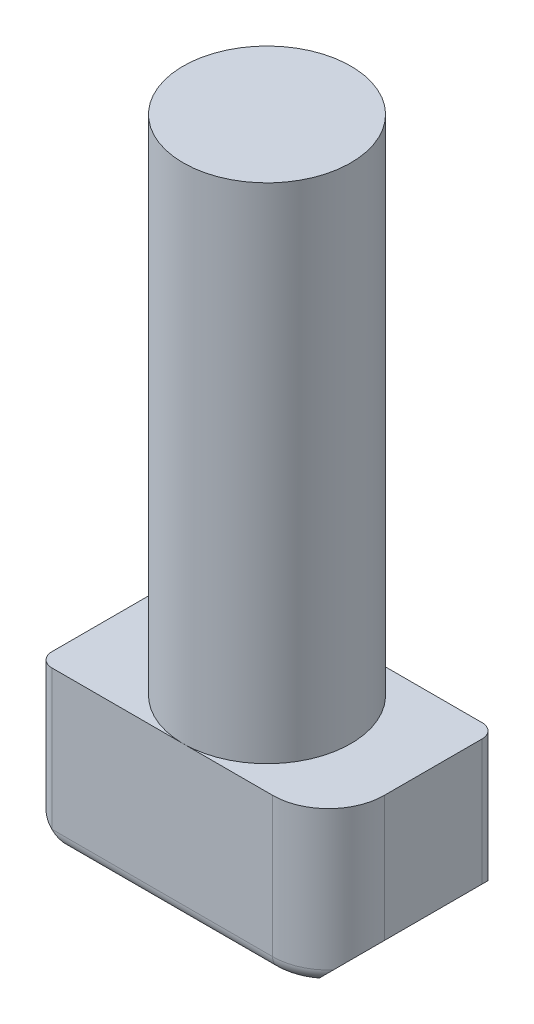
ISO-10303-21;
HEADER;
FILE_DESCRIPTION(('STEP AP214'),'2;1');
FILE_NAME('part.step','',(''),(''),'','','');
FILE_SCHEMA(('AUTOMOTIVE_DESIGN { 1 0 10303 214 1 1 1 1 }'));
ENDSEC;
DATA;
#1=APPLICATION_CONTEXT('core data for automotive mechanical design processes');
#2=APPLICATION_PROTOCOL_DEFINITION('international standard','automotive_design',2000,#1);
#3=PRODUCT_CONTEXT('',#1,'mechanical');
#4=PRODUCT('Part','Part','',(#3));
#5=PRODUCT_RELATED_PRODUCT_CATEGORY('part','',(#4));
#6=PRODUCT_DEFINITION_FORMATION('','',#4);
#7=PRODUCT_DEFINITION_CONTEXT('part definition',#1,'design');
#8=PRODUCT_DEFINITION('design','',#6,#7);
#9=PRODUCT_DEFINITION_SHAPE('','',#8);
#10=(LENGTH_UNIT() NAMED_UNIT(*) SI_UNIT(.MILLI.,.METRE.));
#11=(NAMED_UNIT(*) PLANE_ANGLE_UNIT() SI_UNIT($,.RADIAN.));
#12=(NAMED_UNIT(*) SI_UNIT($,.STERADIAN.) SOLID_ANGLE_UNIT());
#13=UNCERTAINTY_MEASURE_WITH_UNIT(LENGTH_MEASURE(1.E-05),#10,'distance_accuracy_value','');
#14=(GEOMETRIC_REPRESENTATION_CONTEXT(3) GLOBAL_UNCERTAINTY_ASSIGNED_CONTEXT((#13)) GLOBAL_UNIT_ASSIGNED_CONTEXT((#10,
#11,#12)) REPRESENTATION_CONTEXT('',''));
#15=CARTESIAN_POINT('',(0.,0.,0.));
#16=DIRECTION('',(0.,0.,1.));
#17=DIRECTION('',(1.,0.,0.));
#18=AXIS2_PLACEMENT_3D('',#15,#16,#17);
#19=CARTESIAN_POINT('',(5.2,5.50000000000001,3.));
#20=DIRECTION('',(0.,-1.,0.));
#21=DIRECTION('',(0.,0.,-1.));
#22=AXIS2_PLACEMENT_3D('',#19,#20,#21);
#23=PLANE('',#22);
#24=CARTESIAN_POINT('',(0.,5.50000000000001,0.));
#25=DIRECTION('',(0.,1.,0.));
#26=DIRECTION('',(0.,0.,1.));
#27=AXIS2_PLACEMENT_3D('',#24,#25,#26);
#28=CIRCLE('',#27,3.);
#29=CARTESIAN_POINT('',(0.,5.50000000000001,3.));
#30=VERTEX_POINT('',#29);
#31=CARTESIAN_POINT('',(0.,5.50000000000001,-3.));
#32=VERTEX_POINT('',#31);
#33=EDGE_CURVE('E46',#30,#32,#28,.T.);
#34=ORIENTED_EDGE('',*,*,#33,.F.);
#35=DIRECTION('',(-1.,0.,0.));
#36=VECTOR('',#35,1.);
#37=CARTESIAN_POINT('',(5.2,5.50000000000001,3.));
#38=LINE('',#37,#36);
#39=CARTESIAN_POINT('',(3.2,5.50000000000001,3.));
#40=VERTEX_POINT('',#39);
#41=EDGE_CURVE('E144',#40,#30,#38,.T.);
#42=ORIENTED_EDGE('',*,*,#41,.F.);
#43=CARTESIAN_POINT('',(3.2,5.50000000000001,0.999999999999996));
#44=DIRECTION('',(0.,-1.,0.));
#45=DIRECTION('',(0.,0.,-1.));
#46=AXIS2_PLACEMENT_3D('',#43,#44,#45);
#47=CIRCLE('',#46,2.);
#48=CARTESIAN_POINT('',(5.2,5.50000000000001,0.999999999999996));
#49=VERTEX_POINT('',#48);
#50=EDGE_CURVE('E300',#40,#49,#47,.F.);
#51=ORIENTED_EDGE('',*,*,#50,.T.);
#52=DIRECTION('',(0.,0.,1.));
#53=VECTOR('',#52,1.);
#54=CARTESIAN_POINT('',(5.2,5.50000000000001,3.));
#55=LINE('',#54,#53);
#56=CARTESIAN_POINT('',(5.2,5.50000000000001,-2.5));
#57=VERTEX_POINT('',#56);
#58=EDGE_CURVE('E163',#57,#49,#55,.T.);
#59=ORIENTED_EDGE('',*,*,#58,.F.);
#60=CARTESIAN_POINT('',(4.7,5.50000000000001,-2.5));
#61=DIRECTION('',(0.,-1.,0.));
#62=DIRECTION('',(0.,0.,-1.));
#63=AXIS2_PLACEMENT_3D('',#60,#61,#62);
#64=CIRCLE('',#63,0.5);
#65=CARTESIAN_POINT('',(4.7,5.50000000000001,-3.));
#66=VERTEX_POINT('',#65);
#67=EDGE_CURVE('E59',#57,#66,#64,.F.);
#68=ORIENTED_EDGE('',*,*,#67,.T.);
#69=DIRECTION('',(-1.,0.,0.));
#70=VECTOR('',#69,1.);
#71=CARTESIAN_POINT('',(5.2,5.50000000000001,-3.));
#72=LINE('',#71,#70);
#73=EDGE_CURVE('E167',#66,#32,#72,.T.);
#74=ORIENTED_EDGE('',*,*,#73,.T.);
#75=EDGE_LOOP('',(#34,#42,#51,#59,#68,#74));
#76=FACE_BOUND('',#75,.T.);
#77=ADVANCED_FACE('F35',(#76),#23,.F.);
#78=EDGE_CURVE('E11',#32,#30,#28,.T.);
#79=ORIENTED_EDGE('',*,*,#78,.F.);
#80=CARTESIAN_POINT('',(-3.2,5.50000000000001,-3.));
#81=VERTEX_POINT('',#80);
#82=EDGE_CURVE('E156',#32,#81,#72,.T.);
#83=ORIENTED_EDGE('',*,*,#82,.T.);
#84=CARTESIAN_POINT('',(-3.2,5.50000000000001,-1.));
#85=DIRECTION('',(0.,-1.,0.));
#86=DIRECTION('',(0.,0.,-1.));
#87=AXIS2_PLACEMENT_3D('',#84,#85,#86);
#88=CIRCLE('',#87,2.);
#89=CARTESIAN_POINT('',(-5.2,5.50000000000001,-1.));
#90=VERTEX_POINT('',#89);
#91=EDGE_CURVE('E302',#81,#90,#88,.F.);
#92=ORIENTED_EDGE('',*,*,#91,.T.);
#93=DIRECTION('',(0.,0.,1.));
#94=VECTOR('',#93,1.);
#95=CARTESIAN_POINT('',(-5.2,5.50000000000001,3.));
#96=LINE('',#95,#94);
#97=CARTESIAN_POINT('',(-5.2,5.50000000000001,2.5));
#98=VERTEX_POINT('',#97);
#99=EDGE_CURVE('E288',#90,#98,#96,.T.);
#100=ORIENTED_EDGE('',*,*,#99,.T.);
#101=CARTESIAN_POINT('',(-4.7,5.50000000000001,2.5));
#102=DIRECTION('',(0.,-1.,0.));
#103=DIRECTION('',(0.,0.,-1.));
#104=AXIS2_PLACEMENT_3D('',#101,#102,#103);
#105=CIRCLE('',#104,0.5);
#106=CARTESIAN_POINT('',(-4.7,5.50000000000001,3.));
#107=VERTEX_POINT('',#106);
#108=EDGE_CURVE('E161',#98,#107,#105,.F.);
#109=ORIENTED_EDGE('',*,*,#108,.T.);
#110=EDGE_CURVE('E147',#30,#107,#38,.T.);
#111=ORIENTED_EDGE('',*,*,#110,.F.);
#112=EDGE_LOOP('',(#79,#83,#92,#100,#109,#111));
#113=FACE_BOUND('',#112,.T.);
#114=ADVANCED_FACE('F158',(#113),#23,.F.);
#115=CARTESIAN_POINT('',(5.2,5.50000000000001,3.));
#116=DIRECTION('',(0.,0.,-1.));
#117=DIRECTION('',(-1.,0.,0.));
#118=AXIS2_PLACEMENT_3D('',#115,#116,#117);
#119=PLANE('',#118);
#120=DIRECTION('',(0.,-1.,0.));
#121=VECTOR('',#120,1.);
#122=CARTESIAN_POINT('',(-4.7,5.50000000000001,3.));
#123=LINE('',#122,#121);
#124=CARTESIAN_POINT('',(-4.7,0.500000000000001,3.));
#125=VERTEX_POINT('',#124);
#126=EDGE_CURVE('E219',#107,#125,#123,.T.);
#127=ORIENTED_EDGE('',*,*,#126,.T.);
#128=DIRECTION('',(-1.,0.,0.));
#129=VECTOR('',#128,1.);
#130=CARTESIAN_POINT('',(5.2,0.5,3.));
#131=LINE('',#130,#129);
#132=CARTESIAN_POINT('',(3.2,0.5,3.));
#133=VERTEX_POINT('',#132);
#134=EDGE_CURVE('E338',#125,#133,#131,.F.);
#135=ORIENTED_EDGE('',*,*,#134,.T.);
#136=DIRECTION('',(0.,-1.,0.));
#137=VECTOR('',#136,1.);
#138=CARTESIAN_POINT('',(3.2,5.50000000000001,3.));
#139=LINE('',#138,#137);
#140=EDGE_CURVE('E151',#133,#40,#139,.F.);
#141=ORIENTED_EDGE('',*,*,#140,.T.);
#142=ORIENTED_EDGE('',*,*,#41,.T.);
#143=ORIENTED_EDGE('',*,*,#110,.T.);
#144=EDGE_LOOP('',(#127,#135,#141,#142,#143));
#145=FACE_BOUND('',#144,.T.);
#146=ADVANCED_FACE('F146',(#145),#119,.F.);
#147=CARTESIAN_POINT('',(5.2,0.,3.));
#148=DIRECTION('',(0.,1.,0.));
#149=DIRECTION('',(0.,0.,1.));
#150=AXIS2_PLACEMENT_3D('',#147,#148,#149);
#151=PLANE('',#150);
#152=CARTESIAN_POINT('',(3.2,0.,0.999999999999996));
#153=DIRECTION('',(0.,1.,0.));
#154=DIRECTION('',(0.,0.,1.));
#155=AXIS2_PLACEMENT_3D('',#152,#153,#154);
#156=CIRCLE('',#155,1.5);
#157=CARTESIAN_POINT('',(3.99289321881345,0.,2.27331078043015));
#158=VERTEX_POINT('',#157);
#159=CARTESIAN_POINT('',(3.2,0.,2.5));
#160=VERTEX_POINT('',#159);
#161=EDGE_CURVE('E324',#158,#160,#156,.F.);
#162=ORIENTED_EDGE('',*,*,#161,.T.);
#163=DIRECTION('',(-1.,0.,0.));
#164=VECTOR('',#163,1.);
#165=CARTESIAN_POINT('',(5.2,0.,2.5));
#166=LINE('',#165,#164);
#167=CARTESIAN_POINT('',(-3.99289321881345,0.,2.5));
#168=VERTEX_POINT('',#167);
#169=EDGE_CURVE('E326',#160,#168,#166,.T.);
#170=ORIENTED_EDGE('',*,*,#169,.T.);
#171=DIRECTION('',(0.,0.,1.));
#172=VECTOR('',#171,1.);
#173=CARTESIAN_POINT('',(-3.99289321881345,0.,-2.73205080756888));
#174=LINE('',#173,#172);
#175=CARTESIAN_POINT('',(-3.99289321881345,0.,-2.27331078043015));
#176=VERTEX_POINT('',#175);
#177=EDGE_CURVE('E316',#168,#176,#174,.F.);
#178=ORIENTED_EDGE('',*,*,#177,.T.);
#179=CARTESIAN_POINT('',(-3.2,0.,-1.));
#180=DIRECTION('',(0.,1.,0.));
#181=DIRECTION('',(0.,0.,1.));
#182=AXIS2_PLACEMENT_3D('',#179,#180,#181);
#183=CIRCLE('',#182,1.5);
#184=CARTESIAN_POINT('',(-3.2,0.,-2.5));
#185=VERTEX_POINT('',#184);
#186=EDGE_CURVE('E318',#176,#185,#183,.F.);
#187=ORIENTED_EDGE('',*,*,#186,.T.);
#188=DIRECTION('',(-1.,0.,0.));
#189=VECTOR('',#188,1.);
#190=CARTESIAN_POINT('',(5.2,0.,-2.5));
#191=LINE('',#190,#189);
#192=CARTESIAN_POINT('',(3.99289321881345,0.,-2.5));
#193=VERTEX_POINT('',#192);
#194=EDGE_CURVE('E320',#185,#193,#191,.F.);
#195=ORIENTED_EDGE('',*,*,#194,.T.);
#196=DIRECTION('',(0.,0.,1.));
#197=VECTOR('',#196,1.);
#198=CARTESIAN_POINT('',(3.99289321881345,0.,2.73205080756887));
#199=LINE('',#198,#197);
#200=EDGE_CURVE('E322',#193,#158,#199,.T.);
#201=ORIENTED_EDGE('',*,*,#200,.T.);
#202=EDGE_LOOP('',(#162,#170,#178,#187,#195,#201));
#203=FACE_BOUND('',#202,.T.);
#204=ADVANCED_FACE('F196',(#203),#151,.F.);
#205=CARTESIAN_POINT('',(5.2,5.50000000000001,-3.));
#206=DIRECTION('',(0.,0.,1.));
#207=DIRECTION('',(1.,0.,0.));
#208=AXIS2_PLACEMENT_3D('',#205,#206,#207);
#209=PLANE('',#208);
#210=DIRECTION('',(0.,1.,0.));
#211=VECTOR('',#210,1.);
#212=CARTESIAN_POINT('',(4.7,1.,-3.));
#213=LINE('',#212,#211);
#214=CARTESIAN_POINT('',(4.7,0.5,-3.));
#215=VERTEX_POINT('',#214);
#216=EDGE_CURVE('E266',#66,#215,#213,.F.);
#217=ORIENTED_EDGE('',*,*,#216,.T.);
#218=DIRECTION('',(-1.,0.,0.));
#219=VECTOR('',#218,1.);
#220=CARTESIAN_POINT('',(5.2,0.5,-3.));
#221=LINE('',#220,#219);
#222=CARTESIAN_POINT('',(-3.2,0.5,-3.));
#223=VERTEX_POINT('',#222);
#224=EDGE_CURVE('E270',#215,#223,#221,.T.);
#225=ORIENTED_EDGE('',*,*,#224,.T.);
#226=DIRECTION('',(0.,1.,0.));
#227=VECTOR('',#226,1.);
#228=CARTESIAN_POINT('',(-3.2,5.50000000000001,-3.));
#229=LINE('',#228,#227);
#230=EDGE_CURVE('E297',#223,#81,#229,.T.);
#231=ORIENTED_EDGE('',*,*,#230,.T.);
#232=ORIENTED_EDGE('',*,*,#82,.F.);
#233=ORIENTED_EDGE('',*,*,#73,.F.);
#234=EDGE_LOOP('',(#217,#225,#231,#232,#233));
#235=FACE_BOUND('',#234,.T.);
#236=ADVANCED_FACE('F192',(#235),#209,.F.);
#237=CARTESIAN_POINT('',(5.2,0.,0.));
#238=DIRECTION('',(1.,0.,0.));
#239=DIRECTION('',(0.,0.,-1.));
#240=AXIS2_PLACEMENT_3D('',#237,#238,#239);
#241=PLANE('',#240);
#242=DIRECTION('',(0.,0.,-1.));
#243=VECTOR('',#242,1.);
#244=CARTESIAN_POINT('',(5.2,0.999999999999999,-3.));
#245=LINE('',#244,#243);
#246=CARTESIAN_POINT('',(5.2,0.999999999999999,0.999999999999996));
#247=VERTEX_POINT('',#246);
#248=CARTESIAN_POINT('',(5.2,0.999999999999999,-2.5));
#249=VERTEX_POINT('',#248);
#250=EDGE_CURVE('E294',#247,#249,#245,.T.);
#251=ORIENTED_EDGE('',*,*,#250,.T.);
#252=DIRECTION('',(0.,1.,0.));
#253=VECTOR('',#252,1.);
#254=CARTESIAN_POINT('',(5.2,5.50000000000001,-2.5));
#255=LINE('',#254,#253);
#256=EDGE_CURVE('E44',#249,#57,#255,.T.);
#257=ORIENTED_EDGE('',*,*,#256,.T.);
#258=ORIENTED_EDGE('',*,*,#58,.T.);
#259=DIRECTION('',(0.,-1.,0.));
#260=VECTOR('',#259,1.);
#261=CARTESIAN_POINT('',(5.2,1.,0.999999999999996));
#262=LINE('',#261,#260);
#263=EDGE_CURVE('E309',#49,#247,#262,.T.);
#264=ORIENTED_EDGE('',*,*,#263,.T.);
#265=EDGE_LOOP('',(#251,#257,#258,#264));
#266=FACE_BOUND('',#265,.T.);
#267=ADVANCED_FACE('F195',(#266),#241,.T.);
#268=CARTESIAN_POINT('',(-5.2,0.,0.));
#269=DIRECTION('',(1.,0.,0.));
#270=DIRECTION('',(0.,0.,-1.));
#271=AXIS2_PLACEMENT_3D('',#268,#269,#270);
#272=PLANE('',#271);
#273=DIRECTION('',(0.,0.,1.));
#274=VECTOR('',#273,1.);
#275=CARTESIAN_POINT('',(-5.2,1.,0.));
#276=LINE('',#275,#274);
#277=CARTESIAN_POINT('',(-5.2,1.,-1.));
#278=VERTEX_POINT('',#277);
#279=CARTESIAN_POINT('',(-5.2,1.,2.5));
#280=VERTEX_POINT('',#279);
#281=EDGE_CURVE('E291',#278,#280,#276,.T.);
#282=ORIENTED_EDGE('',*,*,#281,.T.);
#283=DIRECTION('',(0.,-1.,0.));
#284=VECTOR('',#283,1.);
#285=CARTESIAN_POINT('',(-5.2,0.,2.5));
#286=LINE('',#285,#284);
#287=EDGE_CURVE('E274',#280,#98,#286,.F.);
#288=ORIENTED_EDGE('',*,*,#287,.T.);
#289=ORIENTED_EDGE('',*,*,#99,.F.);
#290=DIRECTION('',(0.,1.,0.));
#291=VECTOR('',#290,1.);
#292=CARTESIAN_POINT('',(-5.2,0.,-1.));
#293=LINE('',#292,#291);
#294=EDGE_CURVE('E304',#90,#278,#293,.F.);
#295=ORIENTED_EDGE('',*,*,#294,.T.);
#296=EDGE_LOOP('',(#282,#288,#289,#295));
#297=FACE_BOUND('',#296,.T.);
#298=ADVANCED_FACE('F191',(#297),#272,.F.);
#299=CARTESIAN_POINT('',(-4.2,0.,3.));
#300=DIRECTION('',(0.707106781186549,0.707106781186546,0.));
#301=DIRECTION('',(0.,0.,-1.));
#302=AXIS2_PLACEMENT_3D('',#299,#300,#301);
#303=PLANE('',#302);
#304=CARTESIAN_POINT('',(-3.2,-1.,-1.));
#305=DIRECTION('',(0.707106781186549,0.707106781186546,0.));
#306=DIRECTION('',(-0.707106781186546,0.707106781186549,0.));
#307=AXIS2_PLACEMENT_3D('',#304,#305,#306);
#308=ELLIPSE('',#307,2.8284271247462,2.);
#309=CARTESIAN_POINT('',(-4.7,0.5,-2.3228756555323));
#310=VERTEX_POINT('',#309);
#311=EDGE_CURVE('E306',#278,#310,#308,.F.);
#312=ORIENTED_EDGE('',*,*,#311,.T.);
#313=CARTESIAN_POINT('',(-4.7,0.5,-2.3228756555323));
#314=CARTESIAN_POINT('',(-4.67691929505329,0.476919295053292,-2.34901354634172));
#315=CARTESIAN_POINT('',(-4.65236190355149,0.452361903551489,-2.3730731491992));
#316=CARTESIAN_POINT('',(-4.60023403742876,0.40023403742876,-2.41537261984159));
#317=CARTESIAN_POINT('',(-4.57261327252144,0.372613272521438,-2.43348696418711));
#318=CARTESIAN_POINT('',(-4.52750182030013,0.327501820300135,-2.45514134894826));
#319=CARTESIAN_POINT('',(-4.51072219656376,0.310722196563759,-2.46160181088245));
#320=CARTESIAN_POINT('',(-4.47682207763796,0.276822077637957,-2.47103537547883));
#321=CARTESIAN_POINT('',(-4.45970611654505,0.259706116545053,-2.47403990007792));
#322=CARTESIAN_POINT('',(-4.42640164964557,0.226401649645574,-2.4759296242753));
#323=CARTESIAN_POINT('',(-4.41022211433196,0.210222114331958,-2.47506078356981));
#324=CARTESIAN_POINT('',(-4.37801381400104,0.178013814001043,-2.46913965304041));
#325=CARTESIAN_POINT('',(-4.3619911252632,0.161991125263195,-2.46402367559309));
#326=CARTESIAN_POINT('',(-4.34644660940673,0.146446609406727,-2.45647531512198));
#327=B_SPLINE_CURVE_WITH_KNOTS('',3,(#313,#314,#315,#316,#317,#318,#319,#320,#321,#322,#323,
#324,#325,#326),.UNSPECIFIED.,.F.,.F.,(4,2,2,2,2,2,4),(0.,0.125892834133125,0.254294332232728,
0.327863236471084,0.400757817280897,0.469091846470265,0.538469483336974),.UNSPECIFIED.);
#328=CARTESIAN_POINT('',(-4.34644660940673,0.146446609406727,-2.45647531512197));
#329=VERTEX_POINT('',#328);
#330=EDGE_CURVE('E212',#310,#329,#327,.T.);
#331=ORIENTED_EDGE('',*,*,#330,.T.);
#332=DIRECTION('',(0.,0.,-1.));
#333=VECTOR('',#332,1.);
#334=CARTESIAN_POINT('',(-4.34644660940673,0.146446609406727,3.));
#335=LINE('',#334,#333);
#336=CARTESIAN_POINT('',(-4.34644660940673,0.146446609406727,2.85355339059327));
#337=VERTEX_POINT('',#336);
#338=EDGE_CURVE('E220',#329,#337,#335,.F.);
#339=ORIENTED_EDGE('',*,*,#338,.T.);
#340=CARTESIAN_POINT('',(-4.7,0.5,2.5));
#341=DIRECTION('',(0.707106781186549,0.707106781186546,0.));
#342=DIRECTION('',(-0.707106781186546,0.707106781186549,0.));
#343=AXIS2_PLACEMENT_3D('',#340,#341,#342);
#344=ELLIPSE('',#343,0.707106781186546,0.5);
#345=EDGE_CURVE('E330',#337,#125,#344,.F.);
#346=ORIENTED_EDGE('',*,*,#345,.T.);
#347=CARTESIAN_POINT('',(-4.7,0.5,2.5));
#348=DIRECTION('',(0.707106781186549,0.707106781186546,0.));
#349=DIRECTION('',(0.707106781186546,-0.707106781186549,0.));
#350=AXIS2_PLACEMENT_3D('',#347,#348,#349);
#351=ELLIPSE('',#350,0.707106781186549,0.5);
#352=EDGE_CURVE('E329',#125,#280,#351,.F.);
#353=ORIENTED_EDGE('',*,*,#352,.T.);
#354=ORIENTED_EDGE('',*,*,#281,.F.);
#355=EDGE_LOOP('',(#312,#331,#339,#346,#353,#354));
#356=FACE_BOUND('',#355,.T.);
#357=ADVANCED_FACE('F203',(#356),#303,.F.);
#358=CARTESIAN_POINT('',(5.2,0.999999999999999,0.));
#359=DIRECTION('',(0.707106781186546,-0.707106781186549,0.));
#360=DIRECTION('',(0.,0.,1.));
#361=AXIS2_PLACEMENT_3D('',#358,#359,#360);
#362=PLANE('',#361);
#363=CARTESIAN_POINT('',(3.2,-0.999999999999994,0.999999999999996));
#364=DIRECTION('',(0.707106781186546,-0.707106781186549,0.));
#365=DIRECTION('',(0.707106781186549,0.707106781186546,0.));
#366=AXIS2_PLACEMENT_3D('',#363,#364,#365);
#367=ELLIPSE('',#366,2.82842712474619,2.);
#368=CARTESIAN_POINT('',(4.7,0.5,2.32287565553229));
#369=VERTEX_POINT('',#368);
#370=EDGE_CURVE('E312',#247,#369,#367,.T.);
#371=ORIENTED_EDGE('',*,*,#370,.T.);
#372=CARTESIAN_POINT('',(4.7,0.5,2.32287565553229));
#373=CARTESIAN_POINT('',(4.67691929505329,0.476919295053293,2.34901354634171));
#374=CARTESIAN_POINT('',(4.65236190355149,0.45236190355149,2.37307314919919));
#375=CARTESIAN_POINT('',(4.60023403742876,0.400234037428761,2.41537261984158));
#376=CARTESIAN_POINT('',(4.57261327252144,0.372613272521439,2.43348696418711));
#377=CARTESIAN_POINT('',(4.52750182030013,0.327501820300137,2.45514134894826));
#378=CARTESIAN_POINT('',(4.51072219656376,0.310722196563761,2.46160181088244));
#379=CARTESIAN_POINT('',(4.47682207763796,0.276822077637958,2.47103537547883));
#380=CARTESIAN_POINT('',(4.45970611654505,0.259706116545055,2.47403990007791));
#381=CARTESIAN_POINT('',(4.42640164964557,0.226401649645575,2.47592962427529));
#382=CARTESIAN_POINT('',(4.41022211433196,0.210222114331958,2.47506078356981));
#383=CARTESIAN_POINT('',(4.37801381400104,0.178013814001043,2.46913965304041));
#384=CARTESIAN_POINT('',(4.36199112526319,0.161991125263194,2.46402367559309));
#385=CARTESIAN_POINT('',(4.34644660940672,0.146446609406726,2.45647531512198));
#386=B_SPLINE_CURVE_WITH_KNOTS('',3,(#372,#373,#374,#375,#376,#377,#378,#379,#380,#381,#382,
#383,#384,#385),.UNSPECIFIED.,.F.,.F.,(4,2,2,2,2,2,4),(0.,0.125892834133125,0.254294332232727,
0.327863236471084,0.400757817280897,0.469091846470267,0.538469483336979),.UNSPECIFIED.);
#387=CARTESIAN_POINT('',(4.34644660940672,0.146446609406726,2.45647531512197));
#388=VERTEX_POINT('',#387);
#389=EDGE_CURVE('E260',#369,#388,#386,.T.);
#390=ORIENTED_EDGE('',*,*,#389,.T.);
#391=DIRECTION('',(0.,0.,1.));
#392=VECTOR('',#391,1.);
#393=CARTESIAN_POINT('',(4.34644660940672,0.146446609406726,-3.));
#394=LINE('',#393,#392);
#395=CARTESIAN_POINT('',(4.34644660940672,0.146446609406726,-2.85355339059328));
#396=VERTEX_POINT('',#395);
#397=EDGE_CURVE('E267',#388,#396,#394,.F.);
#398=ORIENTED_EDGE('',*,*,#397,.T.);
#399=CARTESIAN_POINT('',(4.7,0.5,-2.5));
#400=DIRECTION('',(0.707106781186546,-0.707106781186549,0.));
#401=DIRECTION('',(-0.707106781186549,-0.707106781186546,0.));
#402=AXIS2_PLACEMENT_3D('',#399,#400,#401);
#403=ELLIPSE('',#402,0.707106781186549,0.5);
#404=EDGE_CURVE('E345',#396,#215,#403,.T.);
#405=ORIENTED_EDGE('',*,*,#404,.T.);
#406=CARTESIAN_POINT('',(4.7,0.5,-2.5));
#407=DIRECTION('',(0.707106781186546,-0.707106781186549,0.));
#408=DIRECTION('',(-0.707106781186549,-0.707106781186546,0.));
#409=AXIS2_PLACEMENT_3D('',#406,#407,#408);
#410=ELLIPSE('',#409,0.707106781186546,0.5);
#411=EDGE_CURVE('E342',#215,#249,#410,.T.);
#412=ORIENTED_EDGE('',*,*,#411,.T.);
#413=ORIENTED_EDGE('',*,*,#250,.F.);
#414=EDGE_LOOP('',(#371,#390,#398,#405,#412,#413));
#415=FACE_BOUND('',#414,.T.);
#416=ADVANCED_FACE('F207',(#415),#362,.T.);
#417=CARTESIAN_POINT('',(-3.2,5.50000000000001,-1.));
#418=DIRECTION('',(0.,1.,0.));
#419=DIRECTION('',(0.,0.,1.));
#420=AXIS2_PLACEMENT_3D('',#417,#418,#419);
#421=CYLINDRICAL_SURFACE('',#420,2.);
#422=ORIENTED_EDGE('',*,*,#230,.F.);
#423=CARTESIAN_POINT('',(-3.2,0.5,-1.));
#424=DIRECTION('',(0.,1.,0.));
#425=DIRECTION('',(0.,0.,1.));
#426=AXIS2_PLACEMENT_3D('',#423,#424,#425);
#427=CIRCLE('',#426,2.);
#428=EDGE_CURVE('E272',#223,#310,#427,.T.);
#429=ORIENTED_EDGE('',*,*,#428,.T.);
#430=ORIENTED_EDGE('',*,*,#311,.F.);
#431=ORIENTED_EDGE('',*,*,#294,.F.);
#432=ORIENTED_EDGE('',*,*,#91,.F.);
#433=EDGE_LOOP('',(#422,#429,#430,#431,#432));
#434=FACE_BOUND('',#433,.T.);
#435=ADVANCED_FACE('F380',(#434),#421,.T.);
#436=CARTESIAN_POINT('',(3.2,0.,0.999999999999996));
#437=DIRECTION('',(0.,1.,0.));
#438=DIRECTION('',(0.,0.,1.));
#439=AXIS2_PLACEMENT_3D('',#436,#437,#438);
#440=CYLINDRICAL_SURFACE('',#439,2.);
#441=ORIENTED_EDGE('',*,*,#140,.F.);
#442=CARTESIAN_POINT('',(3.2,0.5,0.999999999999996));
#443=DIRECTION('',(0.,1.,0.));
#444=DIRECTION('',(0.,0.,1.));
#445=AXIS2_PLACEMENT_3D('',#442,#443,#444);
#446=CIRCLE('',#445,2.);
#447=EDGE_CURVE('E341',#133,#369,#446,.T.);
#448=ORIENTED_EDGE('',*,*,#447,.T.);
#449=ORIENTED_EDGE('',*,*,#370,.F.);
#450=ORIENTED_EDGE('',*,*,#263,.F.);
#451=ORIENTED_EDGE('',*,*,#50,.F.);
#452=EDGE_LOOP('',(#441,#448,#449,#450,#451));
#453=FACE_BOUND('',#452,.T.);
#454=ADVANCED_FACE('F366',(#453),#440,.T.);
#455=CARTESIAN_POINT('',(5.2,0.5,-2.5));
#456=DIRECTION('',(-1.,0.,0.));
#457=DIRECTION('',(0.,0.,1.));
#458=AXIS2_PLACEMENT_3D('',#455,#456,#457);
#459=CYLINDRICAL_SURFACE('',#458,0.5);
#460=ORIENTED_EDGE('',*,*,#224,.F.);
#461=ORIENTED_EDGE('',*,*,#404,.F.);
#462=CARTESIAN_POINT('',(3.99289321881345,0.5,-2.5));
#463=DIRECTION('',(-0.707106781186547,0.,-0.707106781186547));
#464=DIRECTION('',(-0.707106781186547,0.,0.707106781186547));
#465=AXIS2_PLACEMENT_3D('',#462,#463,#464);
#466=ELLIPSE('',#465,0.707106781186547,0.5);
#467=EDGE_CURVE('E39',#193,#396,#466,.F.);
#468=ORIENTED_EDGE('',*,*,#467,.F.);
#469=ORIENTED_EDGE('',*,*,#194,.F.);
#470=CARTESIAN_POINT('',(-3.2,0.5,-2.5));
#471=DIRECTION('',(-1.,0.,0.));
#472=DIRECTION('',(0.,0.,1.));
#473=AXIS2_PLACEMENT_3D('',#470,#471,#472);
#474=CIRCLE('',#473,0.5);
#475=EDGE_CURVE('E252',#223,#185,#474,.T.);
#476=ORIENTED_EDGE('',*,*,#475,.F.);
#477=EDGE_LOOP('',(#460,#461,#468,#469,#476));
#478=FACE_BOUND('',#477,.T.);
#479=ADVANCED_FACE('F257',(#478),#459,.T.);
#480=CARTESIAN_POINT('',(3.99289321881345,0.5,3.));
#481=DIRECTION('',(0.,0.,-1.));
#482=DIRECTION('',(-1.,0.,0.));
#483=AXIS2_PLACEMENT_3D('',#480,#481,#482);
#484=CYLINDRICAL_SURFACE('',#483,0.5);
#485=ORIENTED_EDGE('',*,*,#467,.T.);
#486=ORIENTED_EDGE('',*,*,#397,.F.);
#487=CARTESIAN_POINT('',(4.34644660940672,0.146446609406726,2.45647531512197));
#488=CARTESIAN_POINT('',(4.32511597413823,0.125091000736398,2.44612281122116));
#489=CARTESIAN_POINT('',(4.30210601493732,0.105965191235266,2.43483843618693));
#490=CARTESIAN_POINT('',(4.2536708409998,0.0723834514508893,2.41076479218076));
#491=CARTESIAN_POINT('',(4.22825076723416,0.057917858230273,2.39797871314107));
#492=CARTESIAN_POINT('',(4.17589652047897,0.0338012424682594,2.37124221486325));
#493=CARTESIAN_POINT('',(4.14896559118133,0.0241403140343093,2.35729426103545));
#494=CARTESIAN_POINT('',(4.09433693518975,0.00958567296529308,2.32852905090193));
#495=CARTESIAN_POINT('',(4.06664024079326,0.00468583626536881,2.313712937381));
#496=CARTESIAN_POINT('',(4.02498260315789,0.000834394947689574,2.29103037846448));
#497=CARTESIAN_POINT('',(4.01104626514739,0.000136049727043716,2.28337526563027));
#498=CARTESIAN_POINT('',(3.99572253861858,6.00630067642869E-06,2.2748812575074));
#499=CARTESIAN_POINT('',(3.9943077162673,4.31352516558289E-09,2.27409629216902));
#500=CARTESIAN_POINT('',(3.99289321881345,0.,2.27331078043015));
#501=B_SPLINE_CURVE_WITH_KNOTS('',3,(#487,#488,#489,#490,#491,#492,#493,#494,#495,#496,#497,
#498,#499,#500),.UNSPECIFIED.,.F.,.F.,(4,2,2,2,2,2,4),(0.,0.0955017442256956,0.190804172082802,
0.285909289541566,0.380891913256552,0.428599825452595,0.433453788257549),.UNSPECIFIED.);
#502=EDGE_CURVE('E245',#158,#388,#501,.F.);
#503=ORIENTED_EDGE('',*,*,#502,.F.);
#504=ORIENTED_EDGE('',*,*,#200,.F.);
#505=EDGE_LOOP('',(#485,#486,#503,#504));
#506=FACE_BOUND('',#505,.T.);
#507=ADVANCED_FACE('F229',(#506),#484,.T.);
#508=CARTESIAN_POINT('',(-3.2,0.5,-1.));
#509=DIRECTION('',(0.,1.,0.));
#510=DIRECTION('',(0.,0.,1.));
#511=AXIS2_PLACEMENT_3D('',#508,#509,#510);
#512=TOROIDAL_SURFACE('',#511,1.5,0.5);
#513=ORIENTED_EDGE('',*,*,#475,.T.);
#514=ORIENTED_EDGE('',*,*,#186,.F.);
#515=CARTESIAN_POINT('',(-4.34644660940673,0.146446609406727,-2.45647531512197));
#516=CARTESIAN_POINT('',(-4.32511597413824,0.1250910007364,-2.44612281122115));
#517=CARTESIAN_POINT('',(-4.30210601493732,0.10596519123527,-2.43483843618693));
#518=CARTESIAN_POINT('',(-4.25367084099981,0.0723834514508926,-2.41076479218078));
#519=CARTESIAN_POINT('',(-4.22825076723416,0.0579178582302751,-2.39797871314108));
#520=CARTESIAN_POINT('',(-4.17589652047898,0.0338012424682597,-2.37124221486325));
#521=CARTESIAN_POINT('',(-4.14896559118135,0.0241403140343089,-2.35729426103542));
#522=CARTESIAN_POINT('',(-4.09433693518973,0.00958567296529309,-2.32852905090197));
#523=CARTESIAN_POINT('',(-4.06664024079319,0.00468583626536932,-2.31371293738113));
#524=CARTESIAN_POINT('',(-4.02498260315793,0.000834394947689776,-2.29103037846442));
#525=CARTESIAN_POINT('',(-4.01104626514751,0.000136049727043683,-2.28337526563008));
#526=CARTESIAN_POINT('',(-3.9957225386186,6.00630067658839E-06,-2.27488125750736));
#527=CARTESIAN_POINT('',(-3.99430771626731,4.31352534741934E-09,-2.27409629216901));
#528=CARTESIAN_POINT('',(-3.99289321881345,0.,-2.27331078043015));
#529=B_SPLINE_CURVE_WITH_KNOTS('',3,(#515,#516,#517,#518,#519,#520,#521,#522,#523,#524,#525,
#526,#527,#528),.UNSPECIFIED.,.F.,.F.,(4,2,2,2,2,2,4),(0.,0.0955017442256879,0.190804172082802,
0.285909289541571,0.380891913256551,0.428599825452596,0.433453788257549),.UNSPECIFIED.);
#530=EDGE_CURVE('E238',#329,#176,#529,.T.);
#531=ORIENTED_EDGE('',*,*,#530,.F.);
#532=ORIENTED_EDGE('',*,*,#330,.F.);
#533=ORIENTED_EDGE('',*,*,#428,.F.);
#534=EDGE_LOOP('',(#513,#514,#531,#532,#533));
#535=FACE_BOUND('',#534,.T.);
#536=ADVANCED_FACE('F223',(#535),#512,.T.);
#537=CARTESIAN_POINT('',(3.2,0.5,0.999999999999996));
#538=DIRECTION('',(0.,1.,0.));
#539=DIRECTION('',(0.,0.,1.));
#540=AXIS2_PLACEMENT_3D('',#537,#538,#539);
#541=TOROIDAL_SURFACE('',#540,1.5,0.5);
#542=ORIENTED_EDGE('',*,*,#389,.F.);
#543=ORIENTED_EDGE('',*,*,#447,.F.);
#544=CARTESIAN_POINT('',(3.2,0.5,2.5));
#545=DIRECTION('',(-1.,0.,0.));
#546=DIRECTION('',(0.,0.,1.));
#547=AXIS2_PLACEMENT_3D('',#544,#545,#546);
#548=CIRCLE('',#547,0.5);
#549=EDGE_CURVE('E246',#160,#133,#548,.T.);
#550=ORIENTED_EDGE('',*,*,#549,.F.);
#551=ORIENTED_EDGE('',*,*,#161,.F.);
#552=ORIENTED_EDGE('',*,*,#502,.T.);
#553=EDGE_LOOP('',(#542,#543,#550,#551,#552));
#554=FACE_BOUND('',#553,.T.);
#555=ADVANCED_FACE('F228',(#554),#541,.T.);
#556=CARTESIAN_POINT('',(-3.99289321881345,0.5,3.));
#557=DIRECTION('',(0.,0.,-1.));
#558=DIRECTION('',(-1.,0.,0.));
#559=AXIS2_PLACEMENT_3D('',#556,#557,#558);
#560=CYLINDRICAL_SURFACE('',#559,0.5);
#561=ORIENTED_EDGE('',*,*,#530,.T.);
#562=ORIENTED_EDGE('',*,*,#177,.F.);
#563=CARTESIAN_POINT('',(-3.99289321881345,0.5,2.5));
#564=DIRECTION('',(-0.707106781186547,0.,-0.707106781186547));
#565=DIRECTION('',(0.707106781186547,0.,-0.707106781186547));
#566=AXIS2_PLACEMENT_3D('',#563,#564,#565);
#567=ELLIPSE('',#566,0.707106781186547,0.5);
#568=EDGE_CURVE('E278',#337,#168,#567,.F.);
#569=ORIENTED_EDGE('',*,*,#568,.F.);
#570=ORIENTED_EDGE('',*,*,#338,.F.);
#571=EDGE_LOOP('',(#561,#562,#569,#570));
#572=FACE_BOUND('',#571,.T.);
#573=ADVANCED_FACE('F231',(#572),#560,.T.);
#574=CARTESIAN_POINT('',(5.2,0.5,2.5));
#575=DIRECTION('',(-1.,0.,0.));
#576=DIRECTION('',(0.,0.,1.));
#577=AXIS2_PLACEMENT_3D('',#574,#575,#576);
#578=CYLINDRICAL_SURFACE('',#577,0.5);
#579=ORIENTED_EDGE('',*,*,#549,.T.);
#580=ORIENTED_EDGE('',*,*,#134,.F.);
#581=ORIENTED_EDGE('',*,*,#345,.F.);
#582=ORIENTED_EDGE('',*,*,#568,.T.);
#583=ORIENTED_EDGE('',*,*,#169,.F.);
#584=EDGE_LOOP('',(#579,#580,#581,#582,#583));
#585=FACE_BOUND('',#584,.T.);
#586=ADVANCED_FACE('F337',(#585),#578,.T.);
#587=CARTESIAN_POINT('',(-4.7,5.50000000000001,2.5));
#588=DIRECTION('',(0.,-1.,0.));
#589=DIRECTION('',(0.,0.,-1.));
#590=AXIS2_PLACEMENT_3D('',#587,#588,#589);
#591=CYLINDRICAL_SURFACE('',#590,0.5);
#592=ORIENTED_EDGE('',*,*,#108,.F.);
#593=ORIENTED_EDGE('',*,*,#287,.F.);
#594=ORIENTED_EDGE('',*,*,#352,.F.);
#595=ORIENTED_EDGE('',*,*,#126,.F.);
#596=EDGE_LOOP('',(#592,#593,#594,#595));
#597=FACE_BOUND('',#596,.T.);
#598=ADVANCED_FACE('F181',(#597),#591,.T.);
#599=CARTESIAN_POINT('',(4.7,0.,-2.5));
#600=DIRECTION('',(0.,-1.,0.));
#601=DIRECTION('',(0.,0.,-1.));
#602=AXIS2_PLACEMENT_3D('',#599,#600,#601);
#603=CYLINDRICAL_SURFACE('',#602,0.5);
#604=ORIENTED_EDGE('',*,*,#411,.F.);
#605=ORIENTED_EDGE('',*,*,#216,.F.);
#606=ORIENTED_EDGE('',*,*,#67,.F.);
#607=ORIENTED_EDGE('',*,*,#256,.F.);
#608=EDGE_LOOP('',(#604,#605,#606,#607));
#609=FACE_BOUND('',#608,.T.);
#610=ADVANCED_FACE('F37',(#609),#603,.T.);
#611=CARTESIAN_POINT('',(0.,23.5,0.));
#612=DIRECTION('',(0.,-1.,0.));
#613=DIRECTION('',(0.,0.,-1.));
#614=AXIS2_PLACEMENT_3D('',#611,#612,#613);
#615=CYLINDRICAL_SURFACE('',#614,3.);
#616=CARTESIAN_POINT('',(0.,23.5,0.));
#617=DIRECTION('',(0.,1.,0.));
#618=DIRECTION('',(0.,0.,1.));
#619=AXIS2_PLACEMENT_3D('',#616,#617,#618);
#620=CIRCLE('',#619,3.);
#621=CARTESIAN_POINT('',(0.,23.5,3.));
#622=VERTEX_POINT('',#621);
#623=EDGE_CURVE('E169',#622,#622,#620,.T.);
#624=ORIENTED_EDGE('',*,*,#623,.F.);
#625=EDGE_LOOP('',(#624));
#626=FACE_BOUND('',#625,.T.);
#627=ORIENTED_EDGE('',*,*,#33,.T.);
#628=ORIENTED_EDGE('',*,*,#78,.T.);
#629=EDGE_LOOP('',(#627,#628));
#630=FACE_BOUND('',#629,.T.);
#631=ADVANCED_FACE('F170',(#626,#630),#615,.T.);
#632=CARTESIAN_POINT('',(0.,23.5,0.));
#633=DIRECTION('',(0.,1.,0.));
#634=DIRECTION('',(0.,0.,1.));
#635=AXIS2_PLACEMENT_3D('',#632,#633,#634);
#636=PLANE('',#635);
#637=ORIENTED_EDGE('',*,*,#623,.T.);
#638=EDGE_LOOP('',(#637));
#639=FACE_BOUND('',#638,.T.);
#640=ADVANCED_FACE('F172',(#639),#636,.T.);
#641=CLOSED_SHELL('',(#77,#114,#146,#204,#236,#267,#298,#357,#416,#435,#454,#479,#507,#536,#555,
#573,#586,#598,#610,#631,#640));
#642=MANIFOLD_SOLID_BREP('B2',#641);
#643=ADVANCED_BREP_SHAPE_REPRESENTATION('',(#18,#642),#14);
#644=SHAPE_DEFINITION_REPRESENTATION(#9,#643);
ENDSEC;
END-ISO-10303-21;
